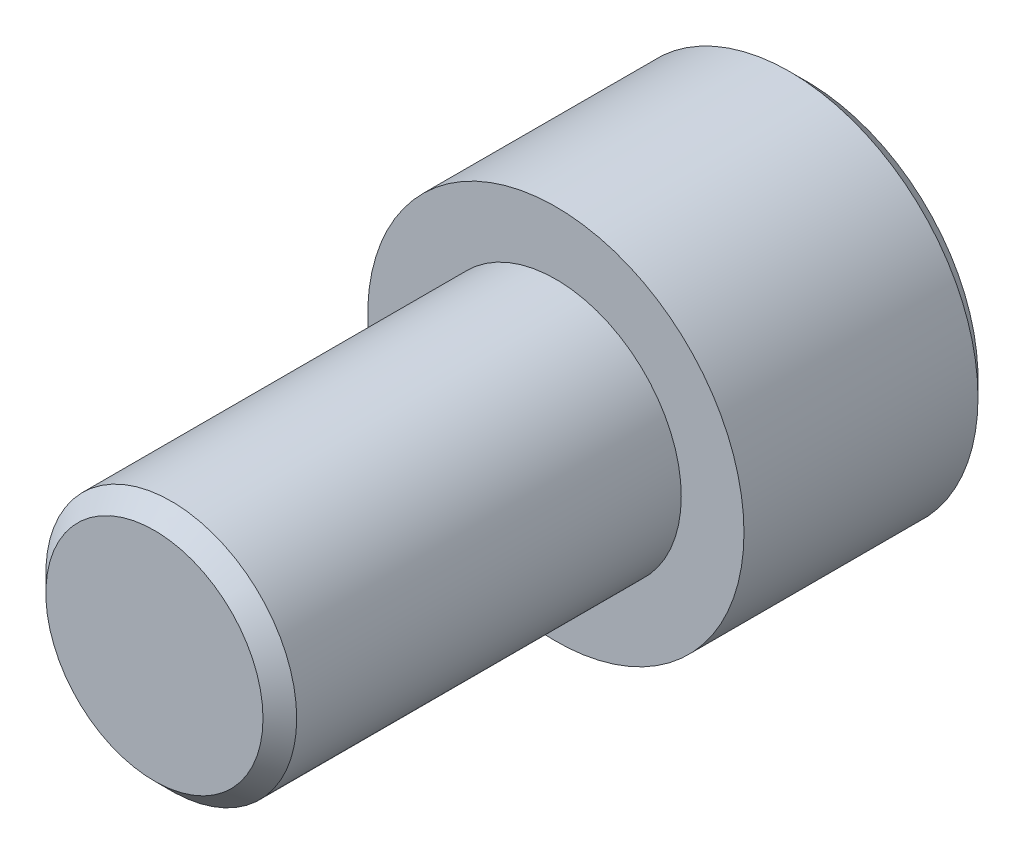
from build123d import *

# Parameters (mm, degrees)
CUT_EXTRUDE1_DEPTH = 6.35
CHAMFER2_SIZE      = 0.5334
CHAMFER3_SIZE      = 0.5334


with BuildPart() as part:
    # Sketch1 → Revolve1 (revolve)
    with BuildSketch(Plane(origin=(0, 0, 0), x_dir=(1, 0, 0), z_dir=(0, 1, 0))):
        Polygon((0, -12.7), (3.96875, -12.7), (3.96875, 0), (5.953125, 0), (5.953125, 7.9375), (0, 7.9375), (0, 0), align=None)
    revolve(axis=Axis((0, 0, 12.7), (0, 0, -1)))

    # Sketch2 → Cut-Extrude1 (cut)
    with BuildSketch(Plane(origin=(0, 0, -7.9375), x_dir=(-1, 0, 0), z_dir=(0, 0, -1))):
        Polygon((-3.18253485, -1.819973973), (-0.01512373, -3.666143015), (3.16741112, -1.846169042), (3.18253485, 1.819973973), (0.01512373, 3.666143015), (-3.16741112, 1.846169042), align=None)
    extrude(amount=-CUT_EXTRUDE1_DEPTH, mode=Mode.SUBTRACT)

    # Chamfer2
    chamfer2_edges = [part.edges().sort_by_distance(p)[0] for p in [
        (-5.953125, 0, -7.9375),
    ]]
    chamfer(chamfer2_edges, length=CHAMFER2_SIZE)

    # Chamfer3
    chamfer3_edges = [part.edges().sort_by_distance(p)[0] for p in [
        (-3.96875, 0, 12.7),
    ]]
    chamfer(chamfer3_edges, length=CHAMFER3_SIZE)


solid = part.part
